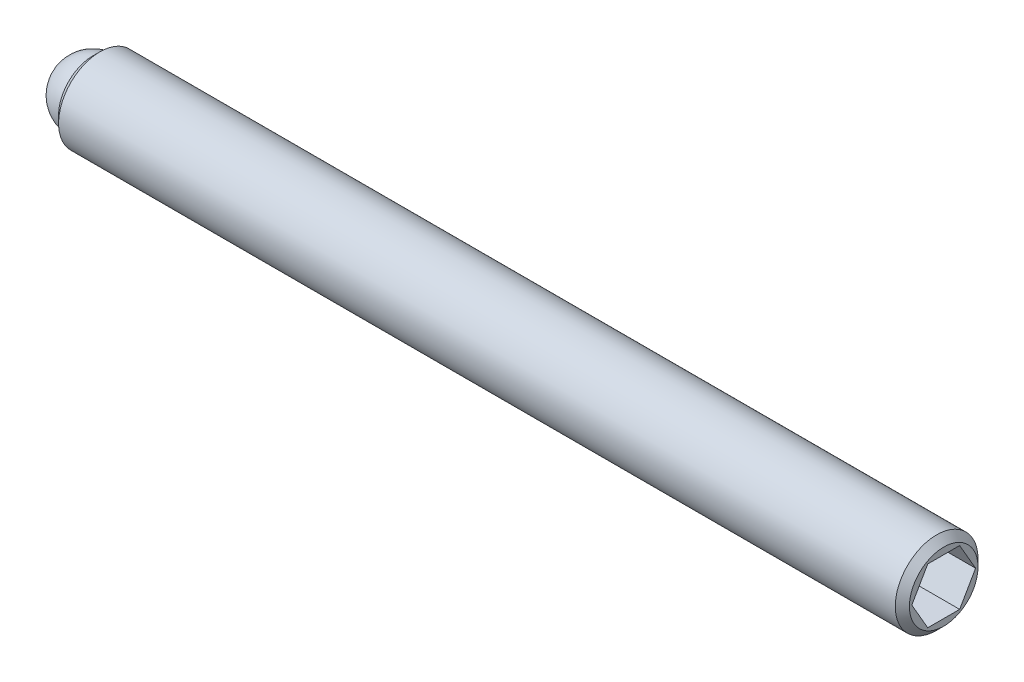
from build123d import *

# Parameters (mm, degrees)
SKETCH2_R           = 1.4859
BOSS_EXTRUDE1_DEPTH = 30.559375
CHAMFER1_SIZE       = 0.254
CHAMFER2_SIZE       = 0.254
CUT_EXTRUDE2_DEPTH  = 2.286
SKETCH3_R           = 1.190625
CUT_EXTRUDE3_DEPTH  = 1.190625


with BuildPart() as part:
    # Sketch2 → Boss-Extrude1 (new body)
    with BuildSketch(Plane(origin=(0, 0, 0), x_dir=(0, 0, -1), z_dir=(1, 0, 0))):
        Circle(SKETCH2_R)
    extrude(amount=BOSS_EXTRUDE1_DEPTH)

    # Chamfer1
    chamfer1_edges = [part.edges().sort_by_distance(p)[0] for p in [
        (0, 0, 1.4859),
    ]]
    chamfer(chamfer1_edges, length=CHAMFER1_SIZE)

    # Chamfer2
    chamfer2_edges = [part.edges().sort_by_distance(p)[0] for p in [
        (30.559375, 0, 1.4859),
    ]]
    chamfer(chamfer2_edges, length=CHAMFER2_SIZE)

    # Sketch4 → Cut-Extrude2 (cut)
    with BuildSketch(Plane(origin=(30.559375, 0, 0), x_dir=(0, 0, -1), z_dir=(1, 0, 0))):
        Polygon((1.14567944, 0), (0.57283972, 0.9921875), (-0.57283972, 0.9921875), (-1.14567944, 0), (-0.57283972, -0.9921875), (0.57283972, -0.9921875), align=None)
    extrude(amount=-CUT_EXTRUDE2_DEPTH, mode=Mode.SUBTRACT)

    # Sketch3 → Cut-Extrude3 (cut)
    with BuildSketch(Plane.ZY):
        Circle(SKETCH3_R)
    extrude(amount=-CUT_EXTRUDE3_DEPTH, mode=Mode.SUBTRACT)


with BuildPart() as body_2:
    # Sketch5 → Revolve1 (revolve)
    with BuildSketch(Plane.ZY):
        with BuildLine():
            Line((0, 0), (0, -1.190625))
            ThreePointArc((0, -1.190625), (-1.190625, 0), (0, 1.190625))
            Line((0, 1.190625), (0, 0))
        make_face()
    revolve(axis=Axis((0, 0, 0), (0, 1, 0)))


solid = Compound([part.part, body_2.part])
